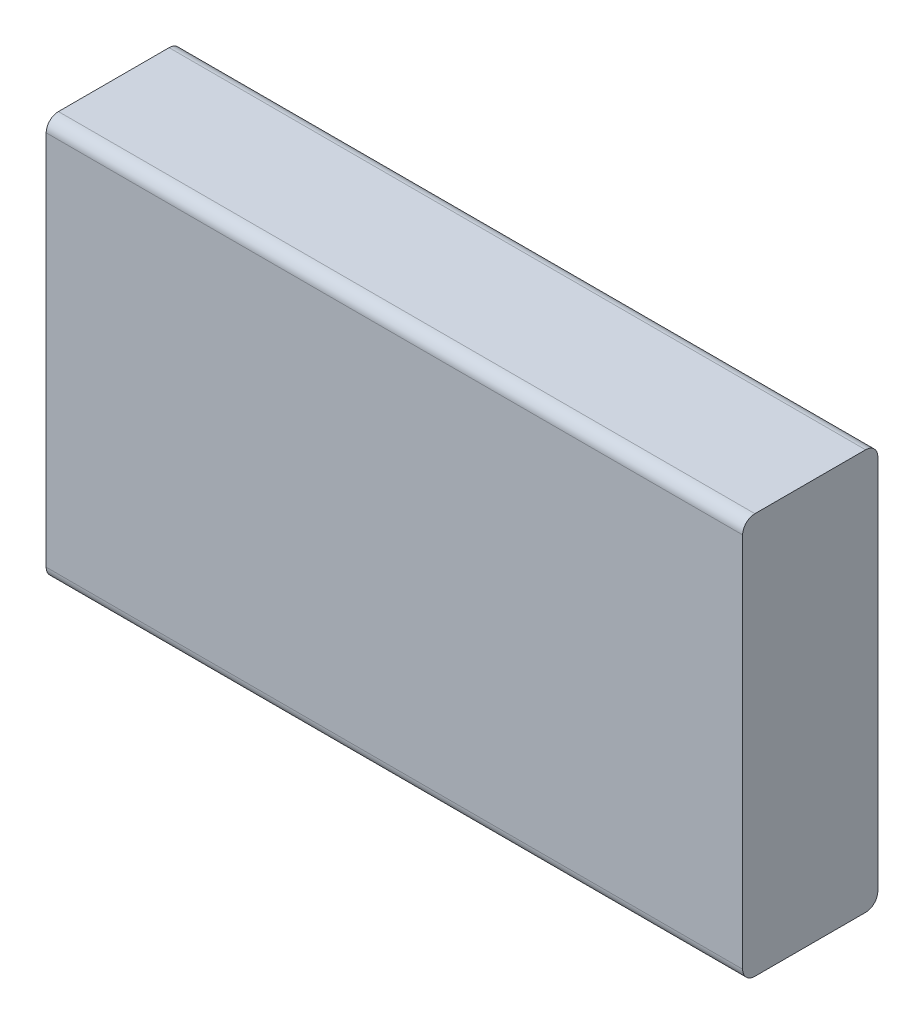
ISO-10303-21;
HEADER;
FILE_DESCRIPTION(('STEP AP214'),'2;1');
FILE_NAME('part.step','',(''),(''),'','','');
FILE_SCHEMA(('AUTOMOTIVE_DESIGN { 1 0 10303 214 1 1 1 1 }'));
ENDSEC;
DATA;
#1=APPLICATION_CONTEXT('core data for automotive mechanical design processes');
#2=APPLICATION_PROTOCOL_DEFINITION('international standard','automotive_design',2000,#1);
#3=PRODUCT_CONTEXT('',#1,'mechanical');
#4=PRODUCT('Part','Part','',(#3));
#5=PRODUCT_RELATED_PRODUCT_CATEGORY('part','',(#4));
#6=PRODUCT_DEFINITION_FORMATION('','',#4);
#7=PRODUCT_DEFINITION_CONTEXT('part definition',#1,'design');
#8=PRODUCT_DEFINITION('design','',#6,#7);
#9=PRODUCT_DEFINITION_SHAPE('','',#8);
#10=(LENGTH_UNIT() NAMED_UNIT(*) SI_UNIT(.MILLI.,.METRE.));
#11=(NAMED_UNIT(*) PLANE_ANGLE_UNIT() SI_UNIT($,.RADIAN.));
#12=(NAMED_UNIT(*) SI_UNIT($,.STERADIAN.) SOLID_ANGLE_UNIT());
#13=UNCERTAINTY_MEASURE_WITH_UNIT(LENGTH_MEASURE(1.E-05),#10,'distance_accuracy_value','');
#14=(GEOMETRIC_REPRESENTATION_CONTEXT(3) GLOBAL_UNCERTAINTY_ASSIGNED_CONTEXT((#13)) GLOBAL_UNIT_ASSIGNED_CONTEXT((#10,
#11,#12)) REPRESENTATION_CONTEXT('',''));
#15=CARTESIAN_POINT('',(0.,0.,0.));
#16=DIRECTION('',(0.,0.,1.));
#17=DIRECTION('',(1.,0.,0.));
#18=AXIS2_PLACEMENT_3D('',#15,#16,#17);
#19=CARTESIAN_POINT('',(0.,0.,28.));
#20=DIRECTION('',(1.,0.,0.));
#21=DIRECTION('',(0.,1.,0.));
#22=AXIS2_PLACEMENT_3D('',#19,#20,#21);
#23=PLANE('',#22);
#24=DIRECTION('',(0.,0.,1.));
#25=VECTOR('',#24,1.);
#26=CARTESIAN_POINT('',(0.,-13.9680534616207,10.19));
#27=LINE('',#26,#25);
#28=CARTESIAN_POINT('',(0.,-13.9680534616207,10.19));
#29=VERTEX_POINT('',#28);
#30=CARTESIAN_POINT('',(0.,-13.9680534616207,17.81));
#31=VERTEX_POINT('',#30);
#32=EDGE_CURVE('E160',#29,#31,#27,.T.);
#33=ORIENTED_EDGE('',*,*,#32,.F.);
#34=DIRECTION('',(0.,-1.,0.));
#35=VECTOR('',#34,1.);
#36=CARTESIAN_POINT('',(0.,-11.4280534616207,10.19));
#37=LINE('',#36,#35);
#38=CARTESIAN_POINT('',(0.,-11.4280534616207,10.19));
#39=VERTEX_POINT('',#38);
#40=EDGE_CURVE('E134',#39,#29,#37,.T.);
#41=ORIENTED_EDGE('',*,*,#40,.F.);
#42=DIRECTION('',(0.,0.,-1.));
#43=VECTOR('',#42,1.);
#44=CARTESIAN_POINT('',(0.,-11.4280534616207,10.19));
#45=LINE('',#44,#43);
#46=CARTESIAN_POINT('',(0.,-11.4280534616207,17.81));
#47=VERTEX_POINT('',#46);
#48=EDGE_CURVE('E151',#47,#39,#45,.T.);
#49=ORIENTED_EDGE('',*,*,#48,.F.);
#50=DIRECTION('',(0.,1.,0.));
#51=VECTOR('',#50,1.);
#52=CARTESIAN_POINT('',(0.,-11.4280534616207,17.81));
#53=LINE('',#52,#51);
#54=EDGE_CURVE('E154',#31,#47,#53,.T.);
#55=ORIENTED_EDGE('',*,*,#54,.F.);
#56=EDGE_LOOP('',(#33,#41,#49,#55));
#57=FACE_BOUND('',#56,.T.);
#58=CARTESIAN_POINT('',(0.,-59.8134614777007,14.1709526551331));
#59=DIRECTION('',(-1.,0.,0.));
#60=DIRECTION('',(0.,-1.,0.));
#61=AXIS2_PLACEMENT_3D('',#58,#59,#60);
#62=CIRCLE('',#61,1.50189763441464);
#63=CARTESIAN_POINT('',(0.,-61.3153591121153,14.1709526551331));
#64=VERTEX_POINT('',#63);
#65=EDGE_CURVE('E161',#64,#64,#62,.T.);
#66=ORIENTED_EDGE('',*,*,#65,.F.);
#67=EDGE_LOOP('',(#66));
#68=FACE_BOUND('',#67,.T.);
#69=DIRECTION('',(0.,0.,-1.));
#70=VECTOR('',#69,1.);
#71=CARTESIAN_POINT('',(0.,0.,28.));
#72=LINE('',#71,#70);
#73=CARTESIAN_POINT('',(0.,0.,25.46));
#74=VERTEX_POINT('',#73);
#75=CARTESIAN_POINT('',(0.,0.,2.54000000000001));
#76=VERTEX_POINT('',#75);
#77=EDGE_CURVE('E183',#74,#76,#72,.T.);
#78=ORIENTED_EDGE('',*,*,#77,.T.);
#79=CARTESIAN_POINT('',(0.,-2.54,2.54));
#80=DIRECTION('',(1.,0.,0.));
#81=DIRECTION('',(0.,1.,0.));
#82=AXIS2_PLACEMENT_3D('',#79,#80,#81);
#83=CIRCLE('',#82,2.54);
#84=CARTESIAN_POINT('',(0.,-2.54,0.));
#85=VERTEX_POINT('',#84);
#86=EDGE_CURVE('E209',#76,#85,#83,.F.);
#87=ORIENTED_EDGE('',*,*,#86,.T.);
#88=DIRECTION('',(0.,-1.,0.));
#89=VECTOR('',#88,1.);
#90=CARTESIAN_POINT('',(0.,0.,0.));
#91=LINE('',#90,#89);
#92=CARTESIAN_POINT('',(0.,-80.46,0.));
#93=VERTEX_POINT('',#92);
#94=EDGE_CURVE('E167',#85,#93,#91,.T.);
#95=ORIENTED_EDGE('',*,*,#94,.T.);
#96=CARTESIAN_POINT('',(0.,-80.46,2.54));
#97=DIRECTION('',(1.,0.,0.));
#98=DIRECTION('',(0.,1.,0.));
#99=AXIS2_PLACEMENT_3D('',#96,#97,#98);
#100=CIRCLE('',#99,2.54);
#101=CARTESIAN_POINT('',(0.,-83.,2.54000000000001));
#102=VERTEX_POINT('',#101);
#103=EDGE_CURVE('E205',#93,#102,#100,.F.);
#104=ORIENTED_EDGE('',*,*,#103,.T.);
#105=DIRECTION('',(0.,0.,-1.));
#106=VECTOR('',#105,1.);
#107=CARTESIAN_POINT('',(0.,-83.,28.));
#108=LINE('',#107,#106);
#109=CARTESIAN_POINT('',(0.,-83.,25.46));
#110=VERTEX_POINT('',#109);
#111=EDGE_CURVE('E195',#110,#102,#108,.T.);
#112=ORIENTED_EDGE('',*,*,#111,.F.);
#113=CARTESIAN_POINT('',(0.,-80.46,25.46));
#114=DIRECTION('',(1.,0.,0.));
#115=DIRECTION('',(0.,1.,0.));
#116=AXIS2_PLACEMENT_3D('',#113,#114,#115);
#117=CIRCLE('',#116,2.54);
#118=CARTESIAN_POINT('',(0.,-80.46,28.));
#119=VERTEX_POINT('',#118);
#120=EDGE_CURVE('E203',#110,#119,#117,.F.);
#121=ORIENTED_EDGE('',*,*,#120,.T.);
#122=DIRECTION('',(0.,-1.,0.));
#123=VECTOR('',#122,1.);
#124=CARTESIAN_POINT('',(0.,0.,28.));
#125=LINE('',#124,#123);
#126=CARTESIAN_POINT('',(0.,-2.54,28.));
#127=VERTEX_POINT('',#126);
#128=EDGE_CURVE('E176',#127,#119,#125,.T.);
#129=ORIENTED_EDGE('',*,*,#128,.F.);
#130=CARTESIAN_POINT('',(0.,-2.54,25.46));
#131=DIRECTION('',(1.,0.,0.));
#132=DIRECTION('',(0.,1.,0.));
#133=AXIS2_PLACEMENT_3D('',#130,#131,#132);
#134=CIRCLE('',#133,2.54);
#135=EDGE_CURVE('E207',#127,#74,#134,.F.);
#136=ORIENTED_EDGE('',*,*,#135,.T.);
#137=EDGE_LOOP('',(#78,#87,#95,#104,#112,#121,#129,#136));
#138=FACE_BOUND('',#137,.T.);
#139=ADVANCED_FACE('F37',(#57,#68,#138),#23,.F.);
#140=CARTESIAN_POINT('',(0.,-83.,28.));
#141=DIRECTION('',(0.,1.,0.));
#142=DIRECTION('',(0.,0.,1.));
#143=AXIS2_PLACEMENT_3D('',#140,#141,#142);
#144=PLANE('',#143);
#145=ORIENTED_EDGE('',*,*,#111,.T.);
#146=DIRECTION('',(1.,0.,0.));
#147=VECTOR('',#146,1.);
#148=CARTESIAN_POINT('',(0.,-83.,2.54));
#149=LINE('',#148,#147);
#150=CARTESIAN_POINT('',(144.272,-83.,2.54000000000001));
#151=VERTEX_POINT('',#150);
#152=EDGE_CURVE('E11',#102,#151,#149,.T.);
#153=ORIENTED_EDGE('',*,*,#152,.T.);
#154=DIRECTION('',(0.,0.,-1.));
#155=VECTOR('',#154,1.);
#156=CARTESIAN_POINT('',(144.272,-83.,28.));
#157=LINE('',#156,#155);
#158=CARTESIAN_POINT('',(144.272,-83.,25.46));
#159=VERTEX_POINT('',#158);
#160=EDGE_CURVE('E193',#159,#151,#157,.T.);
#161=ORIENTED_EDGE('',*,*,#160,.F.);
#162=DIRECTION('',(1.,0.,0.));
#163=VECTOR('',#162,1.);
#164=CARTESIAN_POINT('',(0.,-83.,25.46));
#165=LINE('',#164,#163);
#166=EDGE_CURVE('E45',#159,#110,#165,.F.);
#167=ORIENTED_EDGE('',*,*,#166,.T.);
#168=EDGE_LOOP('',(#145,#153,#161,#167));
#169=FACE_BOUND('',#168,.T.);
#170=ADVANCED_FACE('F229',(#169),#144,.F.);
#171=CARTESIAN_POINT('',(144.272,0.,28.));
#172=DIRECTION('',(-1.,0.,0.));
#173=DIRECTION('',(0.,0.,1.));
#174=AXIS2_PLACEMENT_3D('',#171,#172,#173);
#175=PLANE('',#174);
#176=DIRECTION('',(0.,1.,0.));
#177=VECTOR('',#176,1.);
#178=CARTESIAN_POINT('',(144.272,0.,0.));
#179=LINE('',#178,#177);
#180=CARTESIAN_POINT('',(144.272,-80.46,0.));
#181=VERTEX_POINT('',#180);
#182=CARTESIAN_POINT('',(144.272,-2.54,0.));
#183=VERTEX_POINT('',#182);
#184=EDGE_CURVE('E180',#181,#183,#179,.T.);
#185=ORIENTED_EDGE('',*,*,#184,.T.);
#186=CARTESIAN_POINT('',(144.272,-2.54,2.54));
#187=DIRECTION('',(-1.,0.,0.));
#188=DIRECTION('',(0.,0.,1.));
#189=AXIS2_PLACEMENT_3D('',#186,#187,#188);
#190=CIRCLE('',#189,2.54);
#191=CARTESIAN_POINT('',(144.272,0.,2.54000000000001));
#192=VERTEX_POINT('',#191);
#193=EDGE_CURVE('E219',#183,#192,#190,.F.);
#194=ORIENTED_EDGE('',*,*,#193,.T.);
#195=DIRECTION('',(0.,0.,-1.));
#196=VECTOR('',#195,1.);
#197=CARTESIAN_POINT('',(144.272,0.,28.));
#198=LINE('',#197,#196);
#199=CARTESIAN_POINT('',(144.272,0.,25.46));
#200=VERTEX_POINT('',#199);
#201=EDGE_CURVE('E190',#200,#192,#198,.T.);
#202=ORIENTED_EDGE('',*,*,#201,.F.);
#203=CARTESIAN_POINT('',(144.272,-2.54,25.46));
#204=DIRECTION('',(-1.,0.,0.));
#205=DIRECTION('',(0.,0.,1.));
#206=AXIS2_PLACEMENT_3D('',#203,#204,#205);
#207=CIRCLE('',#206,2.54);
#208=CARTESIAN_POINT('',(144.272,-2.54,28.));
#209=VERTEX_POINT('',#208);
#210=EDGE_CURVE('E217',#200,#209,#207,.F.);
#211=ORIENTED_EDGE('',*,*,#210,.T.);
#212=DIRECTION('',(0.,1.,0.));
#213=VECTOR('',#212,1.);
#214=CARTESIAN_POINT('',(144.272,0.,28.));
#215=LINE('',#214,#213);
#216=CARTESIAN_POINT('',(144.272,-80.46,28.));
#217=VERTEX_POINT('',#216);
#218=EDGE_CURVE('E179',#217,#209,#215,.T.);
#219=ORIENTED_EDGE('',*,*,#218,.F.);
#220=CARTESIAN_POINT('',(144.272,-80.46,25.46));
#221=DIRECTION('',(-1.,0.,0.));
#222=DIRECTION('',(0.,0.,1.));
#223=AXIS2_PLACEMENT_3D('',#220,#221,#222);
#224=CIRCLE('',#223,2.54);
#225=EDGE_CURVE('E59',#217,#159,#224,.F.);
#226=ORIENTED_EDGE('',*,*,#225,.T.);
#227=ORIENTED_EDGE('',*,*,#160,.T.);
#228=CARTESIAN_POINT('',(144.272,-80.46,2.54));
#229=DIRECTION('',(-1.,0.,0.));
#230=DIRECTION('',(0.,0.,1.));
#231=AXIS2_PLACEMENT_3D('',#228,#229,#230);
#232=CIRCLE('',#231,2.54);
#233=EDGE_CURVE('E52',#151,#181,#232,.F.);
#234=ORIENTED_EDGE('',*,*,#233,.T.);
#235=EDGE_LOOP('',(#185,#194,#202,#211,#219,#226,#227,#234));
#236=FACE_BOUND('',#235,.T.);
#237=ADVANCED_FACE('F239',(#236),#175,.F.);
#238=CARTESIAN_POINT('',(0.,0.,28.));
#239=DIRECTION('',(0.,-1.,0.));
#240=DIRECTION('',(0.,0.,-1.));
#241=AXIS2_PLACEMENT_3D('',#238,#239,#240);
#242=PLANE('',#241);
#243=ORIENTED_EDGE('',*,*,#201,.T.);
#244=DIRECTION('',(-1.,0.,0.));
#245=VECTOR('',#244,1.);
#246=CARTESIAN_POINT('',(0.,0.,2.54));
#247=LINE('',#246,#245);
#248=EDGE_CURVE('E200',#192,#76,#247,.T.);
#249=ORIENTED_EDGE('',*,*,#248,.T.);
#250=ORIENTED_EDGE('',*,*,#77,.F.);
#251=DIRECTION('',(-1.,0.,0.));
#252=VECTOR('',#251,1.);
#253=CARTESIAN_POINT('',(144.272,0.,25.46));
#254=LINE('',#253,#252);
#255=EDGE_CURVE('E198',#74,#200,#254,.F.);
#256=ORIENTED_EDGE('',*,*,#255,.T.);
#257=EDGE_LOOP('',(#243,#249,#250,#256));
#258=FACE_BOUND('',#257,.T.);
#259=ADVANCED_FACE('F247',(#258),#242,.F.);
#260=CARTESIAN_POINT('',(0.,0.,28.));
#261=DIRECTION('',(0.,0.,1.));
#262=DIRECTION('',(1.,0.,0.));
#263=AXIS2_PLACEMENT_3D('',#260,#261,#262);
#264=PLANE('',#263);
#265=ORIENTED_EDGE('',*,*,#218,.T.);
#266=DIRECTION('',(-1.,0.,0.));
#267=VECTOR('',#266,1.);
#268=CARTESIAN_POINT('',(0.,-2.54,28.));
#269=LINE('',#268,#267);
#270=EDGE_CURVE('E224',#209,#127,#269,.T.);
#271=ORIENTED_EDGE('',*,*,#270,.T.);
#272=ORIENTED_EDGE('',*,*,#128,.T.);
#273=DIRECTION('',(1.,0.,0.));
#274=VECTOR('',#273,1.);
#275=CARTESIAN_POINT('',(144.272,-80.46,28.));
#276=LINE('',#275,#274);
#277=EDGE_CURVE('E221',#119,#217,#276,.T.);
#278=ORIENTED_EDGE('',*,*,#277,.T.);
#279=EDGE_LOOP('',(#265,#271,#272,#278));
#280=FACE_BOUND('',#279,.T.);
#281=ADVANCED_FACE('F237',(#280),#264,.T.);
#282=CARTESIAN_POINT('',(0.,0.,0.));
#283=DIRECTION('',(0.,0.,1.));
#284=DIRECTION('',(1.,0.,0.));
#285=AXIS2_PLACEMENT_3D('',#282,#283,#284);
#286=PLANE('',#285);
#287=ORIENTED_EDGE('',*,*,#94,.F.);
#288=DIRECTION('',(-1.,0.,0.));
#289=VECTOR('',#288,1.);
#290=CARTESIAN_POINT('',(0.,-2.54,0.));
#291=LINE('',#290,#289);
#292=EDGE_CURVE('E213',#85,#183,#291,.F.);
#293=ORIENTED_EDGE('',*,*,#292,.T.);
#294=ORIENTED_EDGE('',*,*,#184,.F.);
#295=DIRECTION('',(1.,0.,0.));
#296=VECTOR('',#295,1.);
#297=CARTESIAN_POINT('',(0.,-80.46,0.));
#298=LINE('',#297,#296);
#299=EDGE_CURVE('E211',#181,#93,#298,.F.);
#300=ORIENTED_EDGE('',*,*,#299,.T.);
#301=EDGE_LOOP('',(#287,#293,#294,#300));
#302=FACE_BOUND('',#301,.T.);
#303=ADVANCED_FACE('F255',(#302),#286,.F.);
#304=CARTESIAN_POINT('',(85.09,-59.8134614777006,14.1709526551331));
#305=DIRECTION('',(-1.,0.,0.));
#306=DIRECTION('',(0.,-1.,0.));
#307=AXIS2_PLACEMENT_3D('',#304,#305,#306);
#308=CYLINDRICAL_SURFACE('',#307,1.50189763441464);
#309=CARTESIAN_POINT('',(85.09,-59.8134614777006,14.1709526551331));
#310=DIRECTION('',(-1.,0.,0.));
#311=DIRECTION('',(0.,-1.,0.));
#312=AXIS2_PLACEMENT_3D('',#309,#310,#311);
#313=CIRCLE('',#312,1.50189763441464);
#314=CARTESIAN_POINT('',(85.09,-61.3153591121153,14.1709526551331));
#315=VERTEX_POINT('',#314);
#316=EDGE_CURVE('E173',#315,#315,#313,.T.);
#317=ORIENTED_EDGE('',*,*,#316,.F.);
#318=EDGE_LOOP('',(#317));
#319=FACE_BOUND('',#318,.T.);
#320=ORIENTED_EDGE('',*,*,#65,.T.);
#321=EDGE_LOOP('',(#320));
#322=FACE_BOUND('',#321,.T.);
#323=ADVANCED_FACE('F295',(#319,#322),#308,.F.);
#324=CARTESIAN_POINT('',(85.09,-59.8134614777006,14.1709526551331));
#325=DIRECTION('',(-1.,0.,0.));
#326=DIRECTION('',(0.,-1.,0.));
#327=AXIS2_PLACEMENT_3D('',#324,#325,#326);
#328=PLANE('',#327);
#329=ORIENTED_EDGE('',*,*,#316,.T.);
#330=EDGE_LOOP('',(#329));
#331=FACE_BOUND('',#330,.T.);
#332=ADVANCED_FACE('F294',(#331),#328,.T.);
#333=CARTESIAN_POINT('',(85.09,-11.4280534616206,10.19));
#334=DIRECTION('',(0.,0.,-1.));
#335=DIRECTION('',(-1.,0.,0.));
#336=AXIS2_PLACEMENT_3D('',#333,#334,#335);
#337=PLANE('',#336);
#338=ORIENTED_EDGE('',*,*,#40,.T.);
#339=DIRECTION('',(-1.,0.,0.));
#340=VECTOR('',#339,1.);
#341=CARTESIAN_POINT('',(85.09,-13.9680534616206,10.19));
#342=LINE('',#341,#340);
#343=CARTESIAN_POINT('',(85.09,-13.9680534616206,10.19));
#344=VERTEX_POINT('',#343);
#345=EDGE_CURVE('E127',#344,#29,#342,.T.);
#346=ORIENTED_EDGE('',*,*,#345,.F.);
#347=DIRECTION('',(0.,-1.,0.));
#348=VECTOR('',#347,1.);
#349=CARTESIAN_POINT('',(85.09,-11.4280534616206,10.19));
#350=LINE('',#349,#348);
#351=CARTESIAN_POINT('',(85.09,-11.4280534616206,10.19));
#352=VERTEX_POINT('',#351);
#353=EDGE_CURVE('E131',#352,#344,#350,.T.);
#354=ORIENTED_EDGE('',*,*,#353,.F.);
#355=DIRECTION('',(-1.,0.,0.));
#356=VECTOR('',#355,1.);
#357=CARTESIAN_POINT('',(85.09,-11.4280534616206,10.19));
#358=LINE('',#357,#356);
#359=EDGE_CURVE('E165',#352,#39,#358,.T.);
#360=ORIENTED_EDGE('',*,*,#359,.T.);
#361=EDGE_LOOP('',(#338,#346,#354,#360));
#362=FACE_BOUND('',#361,.T.);
#363=ADVANCED_FACE('F129',(#362),#337,.F.);
#364=CARTESIAN_POINT('',(85.09,-11.4280534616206,10.19));
#365=DIRECTION('',(0.,1.,0.));
#366=DIRECTION('',(-1.,0.,0.));
#367=AXIS2_PLACEMENT_3D('',#364,#365,#366);
#368=PLANE('',#367);
#369=ORIENTED_EDGE('',*,*,#48,.T.);
#370=ORIENTED_EDGE('',*,*,#359,.F.);
#371=DIRECTION('',(0.,0.,-1.));
#372=VECTOR('',#371,1.);
#373=CARTESIAN_POINT('',(85.09,-11.4280534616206,10.19));
#374=LINE('',#373,#372);
#375=CARTESIAN_POINT('',(85.09,-11.4280534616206,17.81));
#376=VERTEX_POINT('',#375);
#377=EDGE_CURVE('E139',#376,#352,#374,.T.);
#378=ORIENTED_EDGE('',*,*,#377,.F.);
#379=DIRECTION('',(-1.,0.,0.));
#380=VECTOR('',#379,1.);
#381=CARTESIAN_POINT('',(85.09,-11.4280534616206,17.81));
#382=LINE('',#381,#380);
#383=EDGE_CURVE('E168',#376,#47,#382,.T.);
#384=ORIENTED_EDGE('',*,*,#383,.T.);
#385=EDGE_LOOP('',(#369,#370,#378,#384));
#386=FACE_BOUND('',#385,.T.);
#387=ADVANCED_FACE('F285',(#386),#368,.F.);
#388=CARTESIAN_POINT('',(85.09,-11.4280534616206,17.81));
#389=DIRECTION('',(0.,0.,1.));
#390=DIRECTION('',(1.,0.,0.));
#391=AXIS2_PLACEMENT_3D('',#388,#389,#390);
#392=PLANE('',#391);
#393=ORIENTED_EDGE('',*,*,#54,.T.);
#394=ORIENTED_EDGE('',*,*,#383,.F.);
#395=DIRECTION('',(0.,1.,0.));
#396=VECTOR('',#395,1.);
#397=CARTESIAN_POINT('',(85.09,-11.4280534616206,17.81));
#398=LINE('',#397,#396);
#399=CARTESIAN_POINT('',(85.09,-13.9680534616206,17.81));
#400=VERTEX_POINT('',#399);
#401=EDGE_CURVE('E147',#400,#376,#398,.T.);
#402=ORIENTED_EDGE('',*,*,#401,.F.);
#403=DIRECTION('',(-1.,0.,0.));
#404=VECTOR('',#403,1.);
#405=CARTESIAN_POINT('',(85.09,-13.9680534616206,17.81));
#406=LINE('',#405,#404);
#407=EDGE_CURVE('E138',#400,#31,#406,.T.);
#408=ORIENTED_EDGE('',*,*,#407,.T.);
#409=EDGE_LOOP('',(#393,#394,#402,#408));
#410=FACE_BOUND('',#409,.T.);
#411=ADVANCED_FACE('F282',(#410),#392,.F.);
#412=CARTESIAN_POINT('',(85.09,-13.9680534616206,10.19));
#413=DIRECTION('',(0.,-1.,0.));
#414=DIRECTION('',(1.,0.,0.));
#415=AXIS2_PLACEMENT_3D('',#412,#413,#414);
#416=PLANE('',#415);
#417=ORIENTED_EDGE('',*,*,#32,.T.);
#418=ORIENTED_EDGE('',*,*,#407,.F.);
#419=DIRECTION('',(0.,0.,1.));
#420=VECTOR('',#419,1.);
#421=CARTESIAN_POINT('',(85.09,-13.9680534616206,10.19));
#422=LINE('',#421,#420);
#423=EDGE_CURVE('E142',#344,#400,#422,.T.);
#424=ORIENTED_EDGE('',*,*,#423,.F.);
#425=ORIENTED_EDGE('',*,*,#345,.T.);
#426=EDGE_LOOP('',(#417,#418,#424,#425));
#427=FACE_BOUND('',#426,.T.);
#428=ADVANCED_FACE('F143',(#427),#416,.F.);
#429=CARTESIAN_POINT('',(85.09,0.,0.));
#430=DIRECTION('',(-1.,0.,0.));
#431=DIRECTION('',(0.,-1.,0.));
#432=AXIS2_PLACEMENT_3D('',#429,#430,#431);
#433=PLANE('',#432);
#434=ORIENTED_EDGE('',*,*,#353,.T.);
#435=ORIENTED_EDGE('',*,*,#423,.T.);
#436=ORIENTED_EDGE('',*,*,#401,.T.);
#437=ORIENTED_EDGE('',*,*,#377,.T.);
#438=EDGE_LOOP('',(#434,#435,#436,#437));
#439=FACE_BOUND('',#438,.T.);
#440=ADVANCED_FACE('F149',(#439),#433,.T.);
#441=CARTESIAN_POINT('',(0.,-2.54,2.54));
#442=DIRECTION('',(-1.,0.,0.));
#443=DIRECTION('',(0.,0.,1.));
#444=AXIS2_PLACEMENT_3D('',#441,#442,#443);
#445=CYLINDRICAL_SURFACE('',#444,2.54);
#446=ORIENTED_EDGE('',*,*,#193,.F.);
#447=ORIENTED_EDGE('',*,*,#292,.F.);
#448=ORIENTED_EDGE('',*,*,#86,.F.);
#449=ORIENTED_EDGE('',*,*,#248,.F.);
#450=EDGE_LOOP('',(#446,#447,#448,#449));
#451=FACE_BOUND('',#450,.T.);
#452=ADVANCED_FACE('F251',(#451),#445,.T.);
#453=CARTESIAN_POINT('',(0.,-2.54,25.46));
#454=DIRECTION('',(1.,0.,0.));
#455=DIRECTION('',(0.,0.,-1.));
#456=AXIS2_PLACEMENT_3D('',#453,#454,#455);
#457=CYLINDRICAL_SURFACE('',#456,2.54);
#458=ORIENTED_EDGE('',*,*,#210,.F.);
#459=ORIENTED_EDGE('',*,*,#255,.F.);
#460=ORIENTED_EDGE('',*,*,#135,.F.);
#461=ORIENTED_EDGE('',*,*,#270,.F.);
#462=EDGE_LOOP('',(#458,#459,#460,#461));
#463=FACE_BOUND('',#462,.T.);
#464=ADVANCED_FACE('F244',(#463),#457,.T.);
#465=CARTESIAN_POINT('',(0.,-80.46,2.54));
#466=DIRECTION('',(1.,0.,0.));
#467=DIRECTION('',(0.,0.,-1.));
#468=AXIS2_PLACEMENT_3D('',#465,#466,#467);
#469=CYLINDRICAL_SURFACE('',#468,2.54);
#470=ORIENTED_EDGE('',*,*,#103,.F.);
#471=ORIENTED_EDGE('',*,*,#299,.F.);
#472=ORIENTED_EDGE('',*,*,#233,.F.);
#473=ORIENTED_EDGE('',*,*,#152,.F.);
#474=EDGE_LOOP('',(#470,#471,#472,#473));
#475=FACE_BOUND('',#474,.T.);
#476=ADVANCED_FACE('F257',(#475),#469,.T.);
#477=CARTESIAN_POINT('',(0.,-80.46,25.46));
#478=DIRECTION('',(-1.,0.,0.));
#479=DIRECTION('',(0.,0.,1.));
#480=AXIS2_PLACEMENT_3D('',#477,#478,#479);
#481=CYLINDRICAL_SURFACE('',#480,2.54);
#482=ORIENTED_EDGE('',*,*,#120,.F.);
#483=ORIENTED_EDGE('',*,*,#166,.F.);
#484=ORIENTED_EDGE('',*,*,#225,.F.);
#485=ORIENTED_EDGE('',*,*,#277,.F.);
#486=EDGE_LOOP('',(#482,#483,#484,#485));
#487=FACE_BOUND('',#486,.T.);
#488=ADVANCED_FACE('F39',(#487),#481,.T.);
#489=CLOSED_SHELL('',(#139,#170,#237,#259,#281,#303,#323,#332,#363,#387,#411,#428,#440,#452,
#464,#476,#488));
#490=MANIFOLD_SOLID_BREP('B2',#489);
#491=ADVANCED_BREP_SHAPE_REPRESENTATION('',(#18,#490),#14);
#492=SHAPE_DEFINITION_REPRESENTATION(#9,#491);
ENDSEC;
END-ISO-10303-21;
